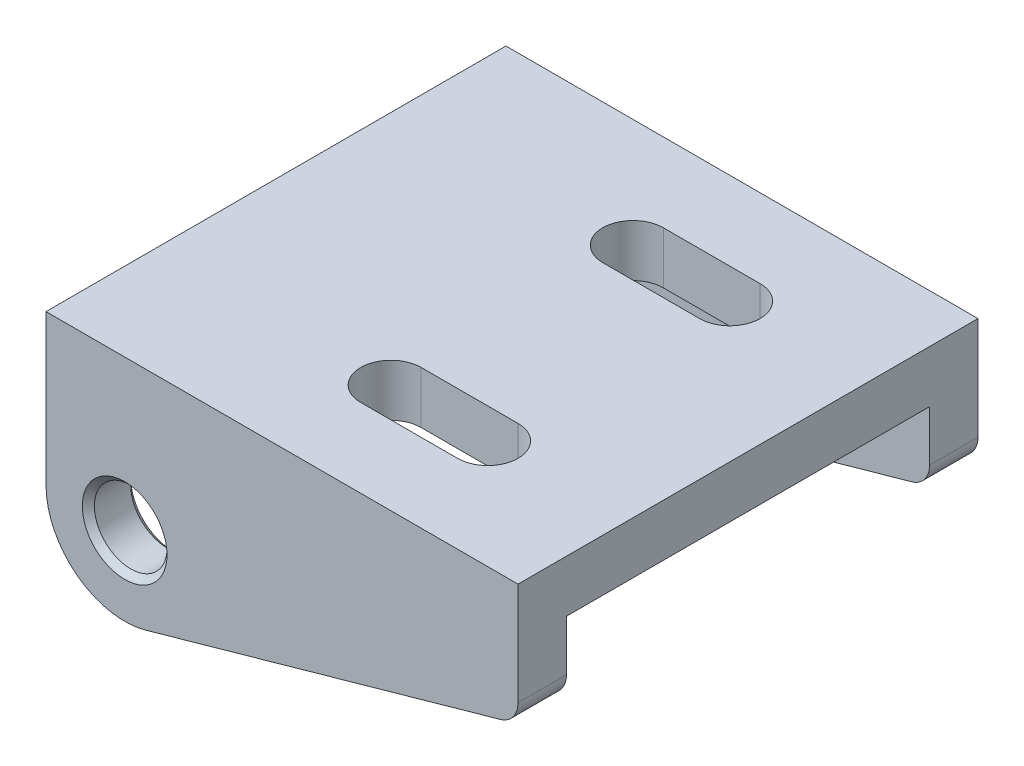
from build123d import *

# Parameters (mm, degrees)
BOSS_EXTRU_1_DEPTH      = 19
BOSS_EXTRU_1_DEPTH_BACK = 19
CONG_1_R                = 6.5
CONG_2_R                = 2
ENL_V_MAT_EXTRU_1_REACH = 49.326
ESQUISSE2_W             = 30
ESQUISSE2_H             = 20
ENL_V_MAT_EXTRU_2_REACH = 59.643
ESQUISSE3_R             = 3
CHANFREIN1_SIZE         = 0.5
ENL_V_MAT_EXTRU_4_DEPTH = 10


with BuildPart() as part:
    # Esquisse1 → Boss.-Extru.1 (new, two sides: drawn at the far end of the back side and taken through both)
    with BuildSketch(Plane.XY.offset(-BOSS_EXTRU_1_DEPTH_BACK)):
        Polygon((0, 0), (39, 0), (39, -10), (0, -21), align=None)
    extrude(amount=BOSS_EXTRU_1_DEPTH + BOSS_EXTRU_1_DEPTH_BACK)

    # Cong_1
    cong_1_edges = [part.edges().sort_by_distance(p)[0] for p in [
        (0, -21, 0),
    ]]
    fillet(cong_1_edges, radius=CONG_1_R)

    # Cong_2
    cong_2_edges = [part.edges().sort_by_distance(p)[0] for p in [
        (39, -10, 0),
    ]]
    fillet(cong_2_edges, radius=CONG_2_R)

    # Esquisse2 → Enl_v. mat.-Extru.1 (cut, up to next)
    with BuildSketch(Plane.ZY, mode=Mode.PRIVATE) as enl_v_mat_extru_1_sk1:
        with Locations((0, -14.3)):
            Rectangle(ESQUISSE2_W, ESQUISSE2_H)
    enl_v_mat_extru_1_tool1 = extrude(enl_v_mat_extru_1_sk1.sketch, amount=-ENL_V_MAT_EXTRU_1_REACH, mode=Mode.PRIVATE) & part.part
    add(enl_v_mat_extru_1_tool1.solids().sort_by_distance((0, -14.3, 0))[0], mode=Mode.SUBTRACT)

    # Enl_v. mat.-Extru.2: up to this face of the body (flat: up to its plane)
    enl_v_mat_extru_2_end = Plane(part.part.faces().sort_by_distance((17.614878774, -7.77678507, 19))[0])
    # Esquisse3 → Enl_v. mat.-Extru.2 (cut, up to the picked face)
    with BuildSketch(Plane(origin=(0, 0, -19), x_dir=(-1, 0, 0), z_dir=(0, 0, -1)), mode=Mode.PRIVATE) as enl_v_mat_extru_2_sk1:
        with Locations((-6.5, -12.413066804)):
            Circle(ESQUISSE3_R)
    enl_v_mat_extru_2_tool1 = split(extrude(enl_v_mat_extru_2_sk1.sketch, amount=-ENL_V_MAT_EXTRU_2_REACH, mode=Mode.PRIVATE), bisect_by=enl_v_mat_extru_2_end, keep=Keep.BOTH, mode=Mode.PRIVATE)
    add(enl_v_mat_extru_2_tool1.solids().sort_by(Axis((6.5, -12.413067, -19), (0, 0, 1)))[0], mode=Mode.SUBTRACT)

    # Chanfrein1
    chanfrein1_edges = [part.edges().sort_by_distance(p)[0] for p in [
        (9.5, -12.413066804, 19),
        (9.5, -12.413066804, 15),
        (9.5, -12.413066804, -15),
        (9.5, -12.413066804, -19),
    ]]
    chamfer(chanfrein1_edges, length=CHANFREIN1_SIZE)

    # Esquisse5 → Enl_v. mat.-Extru.4 (cut)
    with BuildSketch(Plane.XZ.offset(4.3)):
        with BuildLine():
            Line((19.5, 12.5), (27.5, 12.5))
            ThreePointArc((27.5, 12.5), (30, 10), (27.5, 7.5))
            Line((27.5, 7.5), (19.5, 7.5))
            ThreePointArc((19.5, 7.5), (17, 10), (19.5, 12.5))
        make_face()
        with BuildLine():
            Line((19.5, -12.5), (27.5, -12.5))
            ThreePointArc((27.5, -12.5), (30, -10), (27.5, -7.5))
            Line((27.5, -7.5), (19.5, -7.5))
            ThreePointArc((19.5, -7.5), (17, -10), (19.5, -12.5))
        make_face()
    extrude(amount=-ENL_V_MAT_EXTRU_4_DEPTH, mode=Mode.SUBTRACT)


solid = part.part
